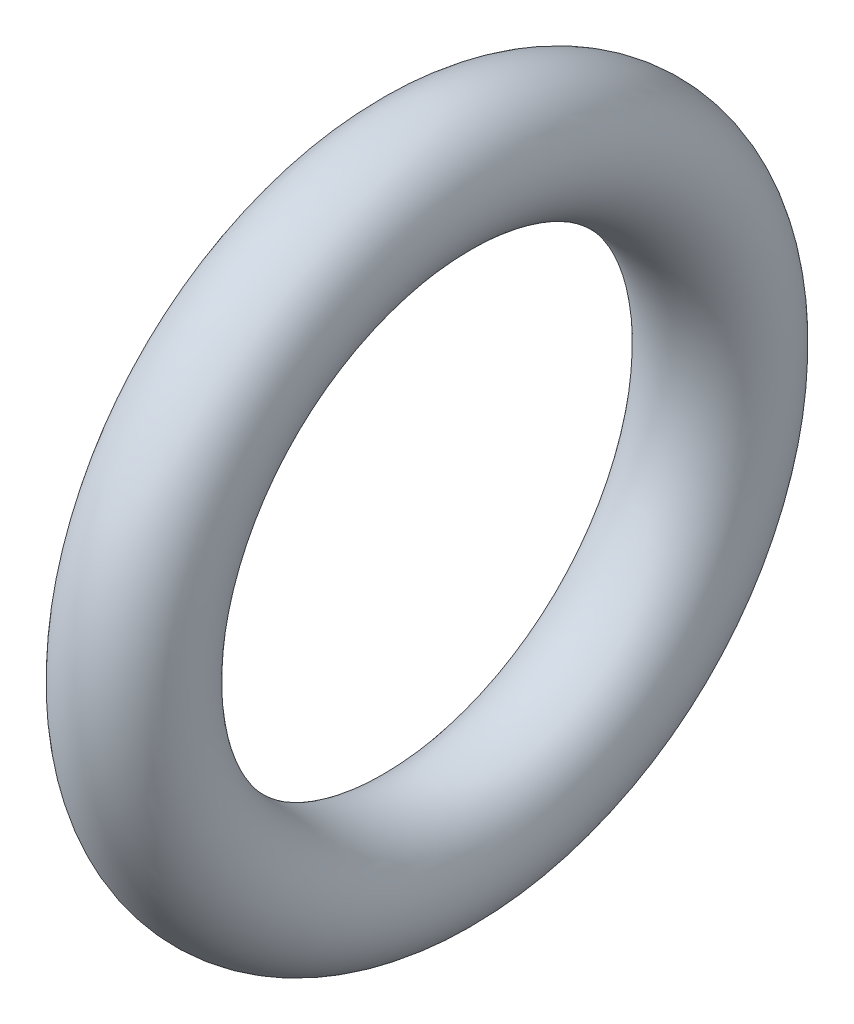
ISO-10303-21;
HEADER;
FILE_DESCRIPTION(('STEP AP214'),'2;1');
FILE_NAME('part.step','',(''),(''),'','','');
FILE_SCHEMA(('AUTOMOTIVE_DESIGN { 1 0 10303 214 1 1 1 1 }'));
ENDSEC;
DATA;
#1=APPLICATION_CONTEXT('core data for automotive mechanical design processes');
#2=APPLICATION_PROTOCOL_DEFINITION('international standard','automotive_design',2000,#1);
#3=PRODUCT_CONTEXT('',#1,'mechanical');
#4=PRODUCT('Part','Part','',(#3));
#5=PRODUCT_RELATED_PRODUCT_CATEGORY('part','',(#4));
#6=PRODUCT_DEFINITION_FORMATION('','',#4);
#7=PRODUCT_DEFINITION_CONTEXT('part definition',#1,'design');
#8=PRODUCT_DEFINITION('design','',#6,#7);
#9=PRODUCT_DEFINITION_SHAPE('','',#8);
#10=(LENGTH_UNIT() NAMED_UNIT(*) SI_UNIT(.MILLI.,.METRE.));
#11=(NAMED_UNIT(*) PLANE_ANGLE_UNIT() SI_UNIT($,.RADIAN.));
#12=(NAMED_UNIT(*) SI_UNIT($,.STERADIAN.) SOLID_ANGLE_UNIT());
#13=UNCERTAINTY_MEASURE_WITH_UNIT(LENGTH_MEASURE(1.E-05),#10,'distance_accuracy_value','');
#14=(GEOMETRIC_REPRESENTATION_CONTEXT(3) GLOBAL_UNCERTAINTY_ASSIGNED_CONTEXT((#13)) GLOBAL_UNIT_ASSIGNED_CONTEXT((#10,
#11,#12)) REPRESENTATION_CONTEXT('',''));
#15=CARTESIAN_POINT('',(0.,0.,0.));
#16=DIRECTION('',(0.,0.,1.));
#17=DIRECTION('',(1.,0.,0.));
#18=AXIS2_PLACEMENT_3D('',#15,#16,#17);
#19=CARTESIAN_POINT('',(4.16536092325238,0.,0.));
#20=DIRECTION('',(1.,0.,0.));
#21=DIRECTION('',(0.,-1.,0.));
#22=AXIS2_PLACEMENT_3D('',#19,#20,#21);
#23=TOROIDAL_SURFACE('',#22,16.75,3.55);
#24=CARTESIAN_POINT('',(4.16536092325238,-20.3,0.));
#25=VERTEX_POINT('',#24);
#26=VERTEX_LOOP('',#25);
#27=FACE_BOUND('',#26,.T.);
#28=ADVANCED_FACE('F13',(#27),#23,.T.);
#29=CLOSED_SHELL('',(#28));
#30=MANIFOLD_SOLID_BREP('B1',#29);
#31=ADVANCED_BREP_SHAPE_REPRESENTATION('',(#18,#30),#14);
#32=SHAPE_DEFINITION_REPRESENTATION(#9,#31);
ENDSEC;
END-ISO-10303-21;
